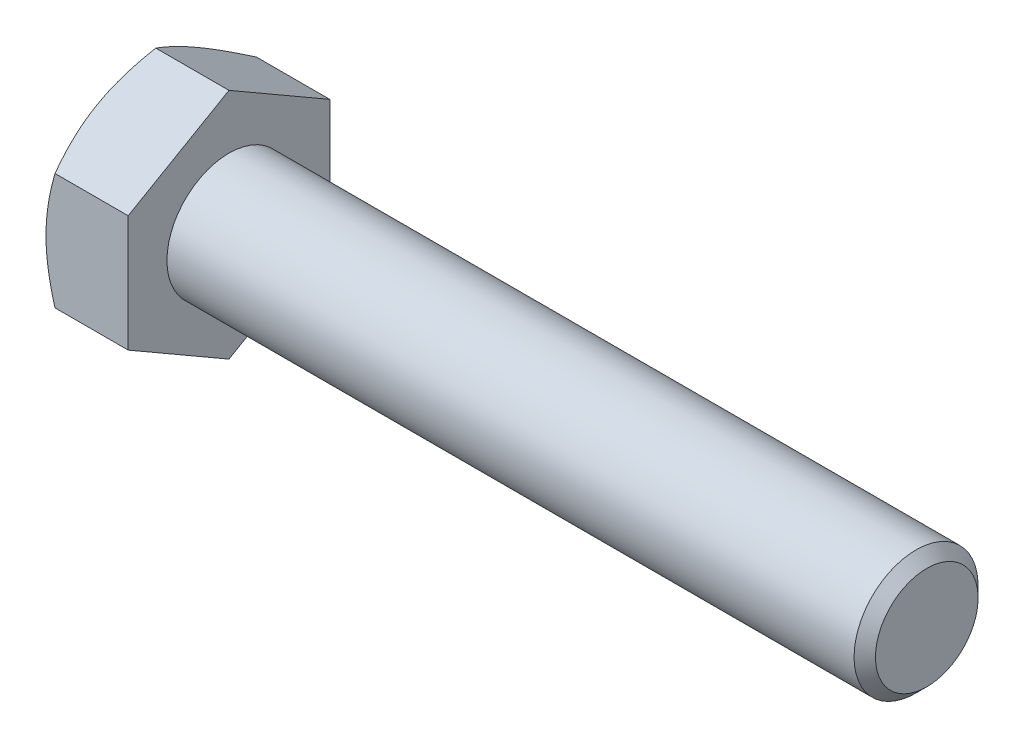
ISO-10303-21;
HEADER;
FILE_DESCRIPTION(('STEP AP214'),'2;1');
FILE_NAME('part.step','',(''),(''),'','','');
FILE_SCHEMA(('AUTOMOTIVE_DESIGN { 1 0 10303 214 1 1 1 1 }'));
ENDSEC;
DATA;
#1=APPLICATION_CONTEXT('core data for automotive mechanical design processes');
#2=APPLICATION_PROTOCOL_DEFINITION('international standard','automotive_design',2000,#1);
#3=PRODUCT_CONTEXT('',#1,'mechanical');
#4=PRODUCT('Part','Part','',(#3));
#5=PRODUCT_RELATED_PRODUCT_CATEGORY('part','',(#4));
#6=PRODUCT_DEFINITION_FORMATION('','',#4);
#7=PRODUCT_DEFINITION_CONTEXT('part definition',#1,'design');
#8=PRODUCT_DEFINITION('design','',#6,#7);
#9=PRODUCT_DEFINITION_SHAPE('','',#8);
#10=(LENGTH_UNIT() NAMED_UNIT(*) SI_UNIT(.MILLI.,.METRE.));
#11=(NAMED_UNIT(*) PLANE_ANGLE_UNIT() SI_UNIT($,.RADIAN.));
#12=(NAMED_UNIT(*) SI_UNIT($,.STERADIAN.) SOLID_ANGLE_UNIT());
#13=UNCERTAINTY_MEASURE_WITH_UNIT(LENGTH_MEASURE(1.E-05),#10,'distance_accuracy_value','');
#14=(GEOMETRIC_REPRESENTATION_CONTEXT(3) GLOBAL_UNCERTAINTY_ASSIGNED_CONTEXT((#13)) GLOBAL_UNIT_ASSIGNED_CONTEXT((#10,
#11,#12)) REPRESENTATION_CONTEXT('',''));
#15=CARTESIAN_POINT('',(0.,0.,0.));
#16=DIRECTION('',(0.,0.,1.));
#17=DIRECTION('',(1.,0.,0.));
#18=AXIS2_PLACEMENT_3D('',#15,#16,#17);
#19=CARTESIAN_POINT('',(5.3,3.75277674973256,-6.5));
#20=DIRECTION('',(0.,-0.866025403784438,0.500000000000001));
#21=DIRECTION('',(0.,-0.500000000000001,-0.866025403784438));
#22=AXIS2_PLACEMENT_3D('',#19,#20,#21);
#23=PLANE('',#22);
#24=CARTESIAN_POINT('',(0.580623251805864,7.50566896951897,0.0002));
#25=CARTESIAN_POINT('',(0.533004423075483,7.4231786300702,-0.14267745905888));
#26=CARTESIAN_POINT('',(0.487546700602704,7.34038072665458,-0.286087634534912));
#27=CARTESIAN_POINT('',(0.401548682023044,7.17411251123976,-0.574072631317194));
#28=CARTESIAN_POINT('',(0.361010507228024,7.09064192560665,-0.718647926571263));
#29=CARTESIAN_POINT('',(0.247571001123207,6.83889369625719,-1.15468865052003));
#30=CARTESIAN_POINT('',(0.183047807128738,6.66962231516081,-1.44787528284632));
#31=CARTESIAN_POINT('',(0.107386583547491,6.41631077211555,-1.88662374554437));
#32=CARTESIAN_POINT('',(0.0858328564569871,6.33302748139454,-2.03087463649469));
#33=CARTESIAN_POINT('',(0.0496903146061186,6.16608458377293,-2.32002821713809));
#34=CARTESIAN_POINT('',(0.0351008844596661,6.08242501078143,-2.46493084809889));
#35=CARTESIAN_POINT('',(0.0132587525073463,5.91496056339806,-2.75498777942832));
#36=CARTESIAN_POINT('',(0.00599772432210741,5.8311559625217,-2.90014160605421));
#37=CARTESIAN_POINT('',(-0.00103969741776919,5.66347396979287,-3.19057533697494));
#38=CARTESIAN_POINT('',(-0.000816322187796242,5.5795965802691,-3.33585523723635));
#39=CARTESIAN_POINT('',(0.0100834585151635,5.34979921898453,-3.73387594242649));
#40=CARTESIAN_POINT('',(0.0283818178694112,5.20395446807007,-3.98648646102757));
#41=CARTESIAN_POINT('',(0.0864063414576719,4.91323365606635,-4.49002967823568));
#42=CARTESIAN_POINT('',(0.126152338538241,4.76835861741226,-4.74096060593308));
#43=CARTESIAN_POINT('',(0.225505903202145,4.47705272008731,-5.24551722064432));
#44=CARTESIAN_POINT('',(0.285534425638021,4.33065861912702,-5.49907924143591));
#45=CARTESIAN_POINT('',(0.421774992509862,4.04005357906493,-6.00242193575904));
#46=CARTESIAN_POINT('',(0.497955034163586,3.89583891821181,-6.25220905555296));
#47=CARTESIAN_POINT('',(0.58062325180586,3.75266127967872,-6.5002));
#48=B_SPLINE_CURVE_WITH_KNOTS('',3,(#24,#25,#26,#27,#28,#29,#30,#31,#32,#33,#34,#35,#36,#37,#38,
#39,#40,#41,#42,#43,#44,#45,#46,#47),.UNSPECIFIED.,.F.,.F.,(4,2,2,2,2,2,2,2,2,2,2,4),(0.,
0.515105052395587,1.03043143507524,2.06322554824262,2.56697389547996,3.07067772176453,
3.57380860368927,4.0769239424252,4.9527935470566,5.82947446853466,6.72559912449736,
7.61996451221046),.UNSPECIFIED.);
#49=CARTESIAN_POINT('',(0.58055658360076,7.50555349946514,0.));
#50=VERTEX_POINT('',#49);
#51=CARTESIAN_POINT('',(0.,5.62916512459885,-3.25000000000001));
#52=VERTEX_POINT('',#51);
#53=EDGE_CURVE('E54',#50,#52,#48,.T.);
#54=ORIENTED_EDGE('',*,*,#53,.F.);
#55=DIRECTION('',(-1.,0.,0.));
#56=VECTOR('',#55,1.);
#57=CARTESIAN_POINT('',(5.3,7.50555349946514,0.));
#58=LINE('',#57,#56);
#59=CARTESIAN_POINT('',(5.3,7.50555349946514,0.));
#60=VERTEX_POINT('',#59);
#61=EDGE_CURVE('E150',#60,#50,#58,.T.);
#62=ORIENTED_EDGE('',*,*,#61,.F.);
#63=DIRECTION('',(0.,0.500000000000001,0.866025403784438));
#64=VECTOR('',#63,1.);
#65=CARTESIAN_POINT('',(5.3,3.75277674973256,-6.5));
#66=LINE('',#65,#64);
#67=CARTESIAN_POINT('',(5.3,3.75277674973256,-6.5));
#68=VERTEX_POINT('',#67);
#69=EDGE_CURVE('E235',#68,#60,#66,.T.);
#70=ORIENTED_EDGE('',*,*,#69,.F.);
#71=DIRECTION('',(-1.,0.,0.));
#72=VECTOR('',#71,1.);
#73=CARTESIAN_POINT('',(5.3,3.75277674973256,-6.5));
#74=LINE('',#73,#72);
#75=CARTESIAN_POINT('',(0.580556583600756,3.75277674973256,-6.5));
#76=VERTEX_POINT('',#75);
#77=EDGE_CURVE('E138',#68,#76,#74,.T.);
#78=ORIENTED_EDGE('',*,*,#77,.T.);
#79=EDGE_CURVE('E132',#52,#76,#48,.T.);
#80=ORIENTED_EDGE('',*,*,#79,.F.);
#81=EDGE_LOOP('',(#54,#62,#70,#78,#80));
#82=FACE_BOUND('',#81,.T.);
#83=ADVANCED_FACE('F38',(#82),#23,.F.);
#84=CARTESIAN_POINT('',(5.3,7.50555349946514,0.));
#85=DIRECTION('',(0.,-0.866025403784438,-0.500000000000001));
#86=DIRECTION('',(0.,0.500000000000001,-0.866025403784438));
#87=AXIS2_PLACEMENT_3D('',#84,#85,#86);
#88=PLANE('',#87);
#89=CARTESIAN_POINT('',(0.580623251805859,3.75266127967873,6.50019999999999));
#90=CARTESIAN_POINT('',(0.533004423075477,3.8351516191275,6.35732254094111));
#91=CARTESIAN_POINT('',(0.487546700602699,3.91794952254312,6.21391236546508));
#92=CARTESIAN_POINT('',(0.401548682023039,4.08421773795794,5.9259273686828));
#93=CARTESIAN_POINT('',(0.361010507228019,4.16768832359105,5.78135207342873));
#94=CARTESIAN_POINT('',(0.247571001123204,4.41943655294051,5.34531134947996));
#95=CARTESIAN_POINT('',(0.183047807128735,4.58870793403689,5.05212471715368));
#96=CARTESIAN_POINT('',(0.107386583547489,4.84201947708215,4.61337625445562));
#97=CARTESIAN_POINT('',(0.0858328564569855,4.92530276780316,4.46912536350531));
#98=CARTESIAN_POINT('',(0.0496903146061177,5.09224566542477,4.17997178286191));
#99=CARTESIAN_POINT('',(0.0351008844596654,5.17590523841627,4.03506915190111));
#100=CARTESIAN_POINT('',(0.0132587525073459,5.34336968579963,3.74501222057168));
#101=CARTESIAN_POINT('',(0.00599772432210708,5.427174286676,3.59985839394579));
#102=CARTESIAN_POINT('',(-0.00103969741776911,5.59485627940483,3.30942466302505));
#103=CARTESIAN_POINT('',(-0.000816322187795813,5.6787336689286,3.16414476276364));
#104=CARTESIAN_POINT('',(0.0100834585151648,5.90853103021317,2.76612405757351));
#105=CARTESIAN_POINT('',(0.0283818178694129,6.05437578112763,2.51351353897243));
#106=CARTESIAN_POINT('',(0.0864063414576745,6.34509659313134,2.00997032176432));
#107=CARTESIAN_POINT('',(0.126152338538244,6.48997163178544,1.75903939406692));
#108=CARTESIAN_POINT('',(0.225505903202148,6.78127752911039,1.25448277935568));
#109=CARTESIAN_POINT('',(0.285534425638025,6.92767163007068,1.00092075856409));
#110=CARTESIAN_POINT('',(0.421774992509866,7.21827667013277,0.497578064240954));
#111=CARTESIAN_POINT('',(0.49795503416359,7.36249133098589,0.247790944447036));
#112=CARTESIAN_POINT('',(0.580623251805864,7.50566896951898,-0.000200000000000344));
#113=B_SPLINE_CURVE_WITH_KNOTS('',3,(#89,#90,#91,#92,#93,#94,#95,#96,#97,#98,#99,#100,#101,#102,
#103,#104,#105,#106,#107,#108,#109,#110,#111,#112),.UNSPECIFIED.,.F.,.F.,(4,2,2,2,2,2,2,2,2,2,2,
4),(0.,0.515105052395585,1.03043143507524,2.06322554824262,2.56697389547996,3.07067772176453,
3.57380860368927,4.07692394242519,4.95279354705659,5.82947446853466,6.72559912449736,
7.61996451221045),.UNSPECIFIED.);
#114=CARTESIAN_POINT('',(0.580556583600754,3.75277674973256,6.49999999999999));
#115=VERTEX_POINT('',#114);
#116=CARTESIAN_POINT('',(0.,5.62916512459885,3.25000000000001));
#117=VERTEX_POINT('',#116);
#118=EDGE_CURVE('E61',#115,#117,#113,.T.);
#119=ORIENTED_EDGE('',*,*,#118,.F.);
#120=DIRECTION('',(-1.,0.,0.));
#121=VECTOR('',#120,1.);
#122=CARTESIAN_POINT('',(5.3,3.75277674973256,6.49999999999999));
#123=LINE('',#122,#121);
#124=CARTESIAN_POINT('',(5.3,3.75277674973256,6.49999999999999));
#125=VERTEX_POINT('',#124);
#126=EDGE_CURVE('E148',#125,#115,#123,.T.);
#127=ORIENTED_EDGE('',*,*,#126,.F.);
#128=DIRECTION('',(0.,-0.500000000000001,0.866025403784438));
#129=VECTOR('',#128,1.);
#130=CARTESIAN_POINT('',(5.3,7.50555349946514,0.));
#131=LINE('',#130,#129);
#132=EDGE_CURVE('E233',#60,#125,#131,.T.);
#133=ORIENTED_EDGE('',*,*,#132,.F.);
#134=ORIENTED_EDGE('',*,*,#61,.T.);
#135=EDGE_CURVE('E165',#117,#50,#113,.T.);
#136=ORIENTED_EDGE('',*,*,#135,.F.);
#137=EDGE_LOOP('',(#119,#127,#133,#134,#136));
#138=FACE_BOUND('',#137,.T.);
#139=ADVANCED_FACE('F171',(#138),#88,.F.);
#140=CARTESIAN_POINT('',(5.3,3.75277674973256,6.49999999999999));
#141=DIRECTION('',(0.,0.,-1.));
#142=DIRECTION('',(0.,1.,0.));
#143=AXIS2_PLACEMENT_3D('',#140,#141,#142);
#144=PLANE('',#143);
#145=CARTESIAN_POINT('',(3.18835311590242,-10.1137456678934,6.5));
#146=CARTESIAN_POINT('',(3.05034774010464,-9.82952666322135,6.5));
#147=CARTESIAN_POINT('',(2.91365616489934,-9.54465869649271,6.5));
#148=CARTESIAN_POINT('',(2.64363899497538,-8.97327978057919,6.5));
#149=CARTESIAN_POINT('',(2.51031392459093,-8.68676858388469,6.5));
#150=CARTESIAN_POINT('',(2.24710473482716,-8.11029837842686,6.5));
#151=CARTESIAN_POINT('',(2.11724300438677,-7.82032911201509,6.5));
#152=CARTESIAN_POINT('',(1.862790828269,-7.23809541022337,6.5));
#153=CARTESIAN_POINT('',(1.73820013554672,-6.94583108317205,6.5));
#154=CARTESIAN_POINT('',(1.49176685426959,-6.34906440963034,6.5));
#155=CARTESIAN_POINT('',(1.37014257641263,-6.0444714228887,6.5));
#156=CARTESIAN_POINT('',(1.13601865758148,-5.43173420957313,6.5));
#157=CARTESIAN_POINT('',(1.02352003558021,-5.12358959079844,6.5));
#158=CARTESIAN_POINT('',(0.810575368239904,-4.50382569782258,6.5));
#159=CARTESIAN_POINT('',(0.710105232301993,-4.19221478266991,6.5));
#160=CARTESIAN_POINT('',(0.524420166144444,-3.5645201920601,6.5));
#161=CARTESIAN_POINT('',(0.439200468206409,-3.24843794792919,6.5));
#162=CARTESIAN_POINT('',(0.288524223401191,-2.61335465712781,6.5));
#163=CARTESIAN_POINT('',(0.222961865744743,-2.29437912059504,6.5));
#164=CARTESIAN_POINT('',(0.115312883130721,-1.65238219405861,6.5));
#165=CARTESIAN_POINT('',(0.0732239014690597,-1.32936121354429,6.5));
#166=CARTESIAN_POINT('',(0.0304887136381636,-0.845231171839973,6.5));
#167=CARTESIAN_POINT('',(0.0196493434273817,-0.68498220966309,6.5));
#168=CARTESIAN_POINT('',(0.00475298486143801,-0.364162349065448,6.5));
#169=CARTESIAN_POINT('',(0.000695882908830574,-0.203591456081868,6.5));
#170=CARTESIAN_POINT('',(-0.000531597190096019,0.117577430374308,6.5));
#171=CARTESIAN_POINT('',(0.00229809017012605,0.278175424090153,6.5));
#172=CARTESIAN_POINT('',(0.014772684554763,0.599108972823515,6.5));
#173=CARTESIAN_POINT('',(0.0244179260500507,0.759444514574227,6.5));
#174=CARTESIAN_POINT('',(0.0554961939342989,1.14369946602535,6.5));
#175=CARTESIAN_POINT('',(0.0801030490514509,1.36736763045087,6.49999999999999));
#176=CARTESIAN_POINT('',(0.141246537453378,1.8130559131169,6.49999999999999));
#177=CARTESIAN_POINT('',(0.177784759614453,2.03507580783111,6.49999999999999));
#178=CARTESIAN_POINT('',(0.303360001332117,2.69839633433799,6.49999999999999));
#179=CARTESIAN_POINT('',(0.408335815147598,3.1367201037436,6.49999999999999));
#180=CARTESIAN_POINT('',(0.590564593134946,3.79232112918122,6.49999999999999));
#181=CARTESIAN_POINT('',(0.656313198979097,4.01299150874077,6.49999999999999));
#182=CARTESIAN_POINT('',(0.794681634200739,4.45218859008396,6.49999999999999));
#183=CARTESIAN_POINT('',(0.867301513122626,4.67071527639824,6.49999999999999));
#184=CARTESIAN_POINT('',(1.01824353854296,5.10569490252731,6.49999999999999));
#185=CARTESIAN_POINT('',(1.0965638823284,5.32214847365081,6.49999999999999));
#186=CARTESIAN_POINT('',(1.25798086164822,5.75325725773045,6.49999999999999));
#187=CARTESIAN_POINT('',(1.34107741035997,5.96791250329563,6.49999999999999));
#188=CARTESIAN_POINT('',(1.56029019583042,6.51888445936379,6.49999999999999));
#189=CARTESIAN_POINT('',(1.69936356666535,6.85402316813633,6.49999999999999));
#190=CARTESIAN_POINT('',(1.98501958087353,7.52109583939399,6.49999999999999));
#191=CARTESIAN_POINT('',(2.13160288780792,7.85302951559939,6.49999999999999));
#192=CARTESIAN_POINT('',(2.43059748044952,8.51437865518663,6.49999999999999));
#193=CARTESIAN_POINT('',(2.58301057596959,8.84379329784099,6.49999999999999));
#194=CARTESIAN_POINT('',(2.89234869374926,9.50047798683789,6.49999999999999));
#195=CARTESIAN_POINT('',(3.04927357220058,9.82774810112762,6.49999999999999));
#196=CARTESIAN_POINT('',(3.36692013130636,10.4809971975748,6.49999999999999));
#197=CARTESIAN_POINT('',(3.52764676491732,10.8069737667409,6.49999999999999));
#198=CARTESIAN_POINT('',(3.85198555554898,11.4574882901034,6.49999999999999));
#199=CARTESIAN_POINT('',(4.01559773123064,11.7820262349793,6.49999999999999));
#200=CARTESIAN_POINT('',(4.50986185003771,12.7537468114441,6.49999999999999));
#201=CARTESIAN_POINT('',(4.84399997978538,13.3991555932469,6.49999999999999));
#202=CARTESIAN_POINT('',(5.48575990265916,14.6239779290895,6.49999999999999));
#203=CARTESIAN_POINT('',(5.79279643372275,15.2036995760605,6.49999999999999));
#204=CARTESIAN_POINT('',(6.41069188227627,16.3611382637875,6.49999999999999));
#205=CARTESIAN_POINT('',(6.72155099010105,16.9388552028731,6.49999999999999));
#206=CARTESIAN_POINT('',(7.3451977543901,18.0910273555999,6.49999999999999));
#207=CARTESIAN_POINT('',(7.6579769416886,18.6654871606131,6.49999999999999));
#208=CARTESIAN_POINT('',(8.28574397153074,19.8131486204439,6.49999999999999));
#209=CARTESIAN_POINT('',(8.60073166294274,20.3863503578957,6.49999999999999));
#210=CARTESIAN_POINT('',(8.91652967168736,20.9591024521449,6.49999999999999));
#211=B_SPLINE_CURVE_WITH_KNOTS('',3,(#145,#146,#147,#148,#149,#150,#151,#152,#153,#154,#155,
#156,#157,#158,#159,#160,#161,#162,#163,#164,#165,#166,#167,#168,#169,#170,#171,#172,#173,#174,
#175,#176,#177,#178,#179,#180,#181,#182,#183,#184,#185,#186,#187,#188,#189,#190,#191,#192,#193,
#194,#195,#196,#197,#198,#199,#200,#201,#202,#203,#204,#205,#206,#207,#208,#209,#210),
.UNSPECIFIED.,.F.,.F.,(4,2,2,2,2,2,2,2,2,2,2,2,2,2,2,2,2,2,2,2,2,2,2,2,2,2,2,2,2,2,2,2,4),(0.,
0.947868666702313,1.89588406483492,2.84900320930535,3.80207763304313,4.78589774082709,
5.76982755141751,6.75175256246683,7.73337005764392,8.70960474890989,9.68574140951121,
10.1674651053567,10.6491807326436,11.1309009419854,11.6126447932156,12.287317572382,
12.9620802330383,14.312318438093,15.0030310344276,15.6937486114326,16.3842486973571,
17.0747362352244,18.1631508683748,19.2516618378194,20.3405135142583,21.4293305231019,
22.5196540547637,23.6099846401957,25.7902468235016,27.7582608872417,29.7263733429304,
31.6886408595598,33.6507753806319),.UNSPECIFIED.);
#212=CARTESIAN_POINT('',(0.580556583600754,-3.75277674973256,6.5));
#213=VERTEX_POINT('',#212);
#214=CARTESIAN_POINT('',(0.,0.,6.5));
#215=VERTEX_POINT('',#214);
#216=EDGE_CURVE('E245',#213,#215,#211,.T.);
#217=ORIENTED_EDGE('',*,*,#216,.F.);
#218=DIRECTION('',(-1.,0.,0.));
#219=VECTOR('',#218,1.);
#220=CARTESIAN_POINT('',(5.3,-3.75277674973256,6.5));
#221=LINE('',#220,#219);
#222=CARTESIAN_POINT('',(5.3,-3.75277674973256,6.5));
#223=VERTEX_POINT('',#222);
#224=EDGE_CURVE('E140',#223,#213,#221,.T.);
#225=ORIENTED_EDGE('',*,*,#224,.F.);
#226=DIRECTION('',(0.,-1.,0.));
#227=VECTOR('',#226,1.);
#228=CARTESIAN_POINT('',(5.3,3.75277674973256,6.49999999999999));
#229=LINE('',#228,#227);
#230=EDGE_CURVE('E229',#125,#223,#229,.T.);
#231=ORIENTED_EDGE('',*,*,#230,.F.);
#232=ORIENTED_EDGE('',*,*,#126,.T.);
#233=EDGE_CURVE('E187',#215,#115,#211,.T.);
#234=ORIENTED_EDGE('',*,*,#233,.F.);
#235=EDGE_LOOP('',(#217,#225,#231,#232,#234));
#236=FACE_BOUND('',#235,.T.);
#237=ADVANCED_FACE('F251',(#236),#144,.F.);
#238=CARTESIAN_POINT('',(5.3,-7.50555349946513,0.));
#239=DIRECTION('',(0.,0.866025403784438,-0.500000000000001));
#240=DIRECTION('',(0.,0.500000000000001,0.866025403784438));
#241=AXIS2_PLACEMENT_3D('',#238,#239,#240);
#242=PLANE('',#241);
#243=CARTESIAN_POINT('',(0.580623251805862,-7.50566896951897,-0.000199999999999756));
#244=CARTESIAN_POINT('',(0.533004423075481,-7.4231786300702,0.14267745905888));
#245=CARTESIAN_POINT('',(0.487546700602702,-7.34038072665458,0.286087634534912));
#246=CARTESIAN_POINT('',(0.401548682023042,-7.17411251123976,0.574072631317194));
#247=CARTESIAN_POINT('',(0.361010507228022,-7.09064192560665,0.718647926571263));
#248=CARTESIAN_POINT('',(0.247571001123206,-6.83889369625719,1.15468865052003));
#249=CARTESIAN_POINT('',(0.183047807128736,-6.6696223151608,1.44787528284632));
#250=CARTESIAN_POINT('',(0.107386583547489,-6.41631077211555,1.88662374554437));
#251=CARTESIAN_POINT('',(0.0858328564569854,-6.33302748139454,2.03087463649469));
#252=CARTESIAN_POINT('',(0.049690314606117,-6.16608458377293,2.32002821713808));
#253=CARTESIAN_POINT('',(0.0351008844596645,-6.08242501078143,2.46493084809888));
#254=CARTESIAN_POINT('',(0.0132587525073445,-5.91496056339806,2.75498777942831));
#255=CARTESIAN_POINT('',(0.00599772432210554,-5.8311559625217,2.9001416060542));
#256=CARTESIAN_POINT('',(-0.00103969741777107,-5.66347396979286,3.19057533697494));
#257=CARTESIAN_POINT('',(-0.000816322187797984,-5.5795965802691,3.33585523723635));
#258=CARTESIAN_POINT('',(0.0100834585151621,-5.34979921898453,3.73387594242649));
#259=CARTESIAN_POINT('',(0.0283818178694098,-5.20395446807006,3.98648646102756));
#260=CARTESIAN_POINT('',(0.0864063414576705,-4.91323365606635,4.49002967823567));
#261=CARTESIAN_POINT('',(0.126152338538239,-4.76835861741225,4.74096060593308));
#262=CARTESIAN_POINT('',(0.225505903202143,-4.47705272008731,5.24551722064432));
#263=CARTESIAN_POINT('',(0.28553442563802,-4.33065861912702,5.49907924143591));
#264=CARTESIAN_POINT('',(0.42177499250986,-4.04005357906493,6.00242193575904));
#265=CARTESIAN_POINT('',(0.497955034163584,-3.89583891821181,6.25220905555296));
#266=CARTESIAN_POINT('',(0.580623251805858,-3.75266127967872,6.5002));
#267=B_SPLINE_CURVE_WITH_KNOTS('',3,(#243,#244,#245,#246,#247,#248,#249,#250,#251,#252,#253,
#254,#255,#256,#257,#258,#259,#260,#261,#262,#263,#264,#265,#266),.UNSPECIFIED.,.F.,.F.,(4,2,2,
2,2,2,2,2,2,2,2,4),(0.,0.515105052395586,1.03043143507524,2.06322554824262,2.56697389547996,
3.07067772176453,3.57380860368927,4.07692394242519,4.9527935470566,5.82947446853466,
6.72559912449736,7.61996451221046),.UNSPECIFIED.);
#268=CARTESIAN_POINT('',(0.580556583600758,-7.50555349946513,0.));
#269=VERTEX_POINT('',#268);
#270=CARTESIAN_POINT('',(0.,-5.62916512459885,3.25000000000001));
#271=VERTEX_POINT('',#270);
#272=EDGE_CURVE('E173',#269,#271,#267,.T.);
#273=ORIENTED_EDGE('',*,*,#272,.F.);
#274=DIRECTION('',(-1.,0.,0.));
#275=VECTOR('',#274,1.);
#276=CARTESIAN_POINT('',(5.3,-7.50555349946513,0.));
#277=LINE('',#276,#275);
#278=CARTESIAN_POINT('',(5.3,-7.50555349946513,0.));
#279=VERTEX_POINT('',#278);
#280=EDGE_CURVE('E137',#279,#269,#277,.T.);
#281=ORIENTED_EDGE('',*,*,#280,.F.);
#282=DIRECTION('',(0.,-0.500000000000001,-0.866025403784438));
#283=VECTOR('',#282,1.);
#284=CARTESIAN_POINT('',(5.3,-7.50555349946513,0.));
#285=LINE('',#284,#283);
#286=EDGE_CURVE('E227',#223,#279,#285,.T.);
#287=ORIENTED_EDGE('',*,*,#286,.F.);
#288=ORIENTED_EDGE('',*,*,#224,.T.);
#289=EDGE_CURVE('E175',#271,#213,#267,.T.);
#290=ORIENTED_EDGE('',*,*,#289,.F.);
#291=EDGE_LOOP('',(#273,#281,#287,#288,#290));
#292=FACE_BOUND('',#291,.T.);
#293=ADVANCED_FACE('F223',(#292),#242,.F.);
#294=CARTESIAN_POINT('',(5.3,-3.75277674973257,-6.5));
#295=DIRECTION('',(0.,0.866025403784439,0.499999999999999));
#296=DIRECTION('',(0.,-0.5,0.866025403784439));
#297=AXIS2_PLACEMENT_3D('',#294,#295,#296);
#298=PLANE('',#297);
#299=CARTESIAN_POINT('',(0.580623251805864,-3.75266127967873,-6.5002));
#300=CARTESIAN_POINT('',(0.533004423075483,-3.83515161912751,-6.35732254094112));
#301=CARTESIAN_POINT('',(0.487546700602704,-3.91794952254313,-6.21391236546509));
#302=CARTESIAN_POINT('',(0.401548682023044,-4.08421773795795,-5.92592736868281));
#303=CARTESIAN_POINT('',(0.361010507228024,-4.16768832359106,-5.78135207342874));
#304=CARTESIAN_POINT('',(0.247571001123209,-4.41943655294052,-5.34531134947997));
#305=CARTESIAN_POINT('',(0.18304780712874,-4.5887079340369,-5.05212471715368));
#306=CARTESIAN_POINT('',(0.107386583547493,-4.84201947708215,-4.61337625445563));
#307=CARTESIAN_POINT('',(0.0858328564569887,-4.92530276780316,-4.46912536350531));
#308=CARTESIAN_POINT('',(0.0496903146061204,-5.09224566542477,-4.17997178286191));
#309=CARTESIAN_POINT('',(0.0351008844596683,-5.17590523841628,-4.03506915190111));
#310=CARTESIAN_POINT('',(0.0132587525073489,-5.34336968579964,-3.74501222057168));
#311=CARTESIAN_POINT('',(0.00599772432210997,-5.427174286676,-3.59985839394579));
#312=CARTESIAN_POINT('',(-0.0010396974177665,-5.59485627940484,-3.30942466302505));
#313=CARTESIAN_POINT('',(-0.000816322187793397,-5.6787336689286,-3.16414476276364));
#314=CARTESIAN_POINT('',(0.0100834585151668,-5.90853103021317,-2.76612405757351));
#315=CARTESIAN_POINT('',(0.0283818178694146,-6.05437578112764,-2.51351353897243));
#316=CARTESIAN_POINT('',(0.0864063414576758,-6.34509659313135,-2.00997032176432));
#317=CARTESIAN_POINT('',(0.126152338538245,-6.48997163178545,-1.75903939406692));
#318=CARTESIAN_POINT('',(0.225505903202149,-6.78127752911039,-1.25448277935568));
#319=CARTESIAN_POINT('',(0.285534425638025,-6.92767163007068,-1.00092075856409));
#320=CARTESIAN_POINT('',(0.421774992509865,-7.21827667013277,-0.497578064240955));
#321=CARTESIAN_POINT('',(0.497955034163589,-7.36249133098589,-0.247790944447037));
#322=CARTESIAN_POINT('',(0.580623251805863,-7.50566896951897,0.000199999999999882));
#323=B_SPLINE_CURVE_WITH_KNOTS('',3,(#299,#300,#301,#302,#303,#304,#305,#306,#307,#308,#309,
#310,#311,#312,#313,#314,#315,#316,#317,#318,#319,#320,#321,#322),.UNSPECIFIED.,.F.,.F.,(4,2,2,
2,2,2,2,2,2,2,2,4),(0.,0.515105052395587,1.03043143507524,2.06322554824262,2.56697389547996,
3.07067772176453,3.57380860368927,4.0769239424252,4.9527935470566,5.82947446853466,
6.72559912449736,7.61996451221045),.UNSPECIFIED.);
#324=CARTESIAN_POINT('',(0.58055658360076,-3.75277674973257,-6.5));
#325=VERTEX_POINT('',#324);
#326=CARTESIAN_POINT('',(0.,-5.62916512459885,-3.25));
#327=VERTEX_POINT('',#326);
#328=EDGE_CURVE('E114',#325,#327,#323,.T.);
#329=ORIENTED_EDGE('',*,*,#328,.F.);
#330=DIRECTION('',(-1.,0.,0.));
#331=VECTOR('',#330,1.);
#332=CARTESIAN_POINT('',(5.3,-3.75277674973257,-6.5));
#333=LINE('',#332,#331);
#334=CARTESIAN_POINT('',(5.3,-3.75277674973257,-6.5));
#335=VERTEX_POINT('',#334);
#336=EDGE_CURVE('E128',#335,#325,#333,.T.);
#337=ORIENTED_EDGE('',*,*,#336,.F.);
#338=DIRECTION('',(0.,0.499999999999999,-0.866025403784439));
#339=VECTOR('',#338,1.);
#340=CARTESIAN_POINT('',(5.3,-3.75277674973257,-6.5));
#341=LINE('',#340,#339);
#342=EDGE_CURVE('E225',#279,#335,#341,.T.);
#343=ORIENTED_EDGE('',*,*,#342,.F.);
#344=ORIENTED_EDGE('',*,*,#280,.T.);
#345=EDGE_CURVE('E131',#327,#269,#323,.T.);
#346=ORIENTED_EDGE('',*,*,#345,.F.);
#347=EDGE_LOOP('',(#329,#337,#343,#344,#346));
#348=FACE_BOUND('',#347,.T.);
#349=ADVANCED_FACE('F126',(#348),#298,.F.);
#350=CARTESIAN_POINT('',(5.3,3.75277674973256,-6.5));
#351=DIRECTION('',(0.,0.,1.));
#352=DIRECTION('',(0.,-1.,0.));
#353=AXIS2_PLACEMENT_3D('',#350,#351,#352);
#354=PLANE('',#353);
#355=CARTESIAN_POINT('',(3.18835311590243,-10.1137456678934,-6.5));
#356=CARTESIAN_POINT('',(3.05034774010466,-9.82952666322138,-6.5));
#357=CARTESIAN_POINT('',(2.91365616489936,-9.54465869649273,-6.5));
#358=CARTESIAN_POINT('',(2.64363899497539,-8.97327978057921,-6.5));
#359=CARTESIAN_POINT('',(2.51031392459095,-8.68676858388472,-6.5));
#360=CARTESIAN_POINT('',(2.24710473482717,-8.11029837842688,-6.5));
#361=CARTESIAN_POINT('',(2.11724300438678,-7.82032911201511,-6.5));
#362=CARTESIAN_POINT('',(1.86279082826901,-7.23809541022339,-6.5));
#363=CARTESIAN_POINT('',(1.73820013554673,-6.94583108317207,-6.5));
#364=CARTESIAN_POINT('',(1.4917668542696,-6.34906440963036,-6.5));
#365=CARTESIAN_POINT('',(1.37014257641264,-6.04447142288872,-6.5));
#366=CARTESIAN_POINT('',(1.13601865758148,-5.43173420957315,-6.5));
#367=CARTESIAN_POINT('',(1.02352003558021,-5.12358959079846,-6.5));
#368=CARTESIAN_POINT('',(0.810575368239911,-4.50382569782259,-6.5));
#369=CARTESIAN_POINT('',(0.710105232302,-4.19221478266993,-6.5));
#370=CARTESIAN_POINT('',(0.52442016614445,-3.56452019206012,-6.5));
#371=CARTESIAN_POINT('',(0.439200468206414,-3.24843794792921,-6.5));
#372=CARTESIAN_POINT('',(0.288524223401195,-2.61335465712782,-6.5));
#373=CARTESIAN_POINT('',(0.222961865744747,-2.29437912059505,-6.5));
#374=CARTESIAN_POINT('',(0.115312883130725,-1.65238219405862,-6.5));
#375=CARTESIAN_POINT('',(0.0732239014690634,-1.3293612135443,-6.5));
#376=CARTESIAN_POINT('',(0.0304887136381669,-0.845231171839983,-6.5));
#377=CARTESIAN_POINT('',(0.0196493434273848,-0.6849822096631,-6.5));
#378=CARTESIAN_POINT('',(0.00475298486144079,-0.364162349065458,-6.5));
#379=CARTESIAN_POINT('',(0.000695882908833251,-0.203591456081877,-6.5));
#380=CARTESIAN_POINT('',(-0.0005315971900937,0.117577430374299,-6.5));
#381=CARTESIAN_POINT('',(0.00229809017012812,0.278175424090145,-6.5));
#382=CARTESIAN_POINT('',(0.014772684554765,0.599108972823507,-6.5));
#383=CARTESIAN_POINT('',(0.0244179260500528,0.759444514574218,-6.5));
#384=CARTESIAN_POINT('',(0.055496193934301,1.14369946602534,-6.5));
#385=CARTESIAN_POINT('',(0.0801030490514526,1.36736763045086,-6.5));
#386=CARTESIAN_POINT('',(0.141246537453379,1.81305591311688,-6.5));
#387=CARTESIAN_POINT('',(0.177784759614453,2.03507580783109,-6.5));
#388=CARTESIAN_POINT('',(0.303360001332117,2.69839633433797,-6.5));
#389=CARTESIAN_POINT('',(0.408335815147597,3.13672010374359,-6.5));
#390=CARTESIAN_POINT('',(0.590564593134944,3.79232112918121,-6.5));
#391=CARTESIAN_POINT('',(0.656313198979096,4.01299150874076,-6.5));
#392=CARTESIAN_POINT('',(0.794681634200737,4.45218859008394,-6.5));
#393=CARTESIAN_POINT('',(0.867301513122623,4.67071527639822,-6.5));
#394=CARTESIAN_POINT('',(1.01824353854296,5.1056949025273,-6.5));
#395=CARTESIAN_POINT('',(1.0965638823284,5.3221484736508,-6.5));
#396=CARTESIAN_POINT('',(1.25798086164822,5.75325725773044,-6.5));
#397=CARTESIAN_POINT('',(1.34107741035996,5.96791250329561,-6.5));
#398=CARTESIAN_POINT('',(1.56029019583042,6.51888445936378,-6.5));
#399=CARTESIAN_POINT('',(1.69936356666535,6.85402316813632,-6.5));
#400=CARTESIAN_POINT('',(1.98501958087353,7.52109583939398,-6.5));
#401=CARTESIAN_POINT('',(2.13160288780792,7.85302951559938,-6.5));
#402=CARTESIAN_POINT('',(2.43059748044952,8.51437865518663,-6.5));
#403=CARTESIAN_POINT('',(2.5830105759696,8.84379329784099,-6.5));
#404=CARTESIAN_POINT('',(2.89234869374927,9.50047798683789,-6.5));
#405=CARTESIAN_POINT('',(3.04927357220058,9.82774810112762,-6.5));
#406=CARTESIAN_POINT('',(3.36692013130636,10.4809971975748,-6.5));
#407=CARTESIAN_POINT('',(3.52764676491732,10.8069737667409,-6.5));
#408=CARTESIAN_POINT('',(3.85198555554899,11.4574882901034,-6.5));
#409=CARTESIAN_POINT('',(4.01559773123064,11.7820262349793,-6.5));
#410=CARTESIAN_POINT('',(4.50986185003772,12.7537468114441,-6.5));
#411=CARTESIAN_POINT('',(4.84399997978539,13.3991555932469,-6.5));
#412=CARTESIAN_POINT('',(5.48575990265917,14.6239779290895,-6.5));
#413=CARTESIAN_POINT('',(5.79279643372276,15.2036995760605,-6.5));
#414=CARTESIAN_POINT('',(6.41069188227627,16.3611382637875,-6.5));
#415=CARTESIAN_POINT('',(6.72155099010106,16.9388552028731,-6.5));
#416=CARTESIAN_POINT('',(7.34519775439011,18.0910273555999,-6.5));
#417=CARTESIAN_POINT('',(7.6579769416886,18.6654871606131,-6.5));
#418=CARTESIAN_POINT('',(8.28574397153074,19.8131486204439,-6.5));
#419=CARTESIAN_POINT('',(8.60073166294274,20.3863503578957,-6.5));
#420=CARTESIAN_POINT('',(8.91652967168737,20.9591024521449,-6.49999999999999));
#421=B_SPLINE_CURVE_WITH_KNOTS('',3,(#355,#356,#357,#358,#359,#360,#361,#362,#363,#364,#365,
#366,#367,#368,#369,#370,#371,#372,#373,#374,#375,#376,#377,#378,#379,#380,#381,#382,#383,#384,
#385,#386,#387,#388,#389,#390,#391,#392,#393,#394,#395,#396,#397,#398,#399,#400,#401,#402,#403,
#404,#405,#406,#407,#408,#409,#410,#411,#412,#413,#414,#415,#416,#417,#418,#419,#420),
.UNSPECIFIED.,.F.,.F.,(4,2,2,2,2,2,2,2,2,2,2,2,2,2,2,2,2,2,2,2,2,2,2,2,2,2,2,2,2,2,2,2,4),(0.,
0.947868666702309,1.89588406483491,2.84900320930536,3.80207763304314,4.7858977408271,
5.76982755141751,6.75175256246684,7.73337005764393,8.7096047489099,9.68574140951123,
10.1674651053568,10.6491807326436,11.1309009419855,11.6126447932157,12.287317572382,
12.9620802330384,14.312318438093,15.0030310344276,15.6937486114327,16.3842486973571,
17.0747362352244,18.1631508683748,19.2516618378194,20.3405135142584,21.429330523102,
22.5196540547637,23.6099846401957,25.7902468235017,27.7582608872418,29.7263733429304,
31.6886408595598,33.6507753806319),.UNSPECIFIED.);
#422=CARTESIAN_POINT('',(0.,0.,-6.5));
#423=VERTEX_POINT('',#422);
#424=EDGE_CURVE('E120',#76,#423,#421,.F.);
#425=ORIENTED_EDGE('',*,*,#424,.F.);
#426=ORIENTED_EDGE('',*,*,#77,.F.);
#427=DIRECTION('',(0.,1.,0.));
#428=VECTOR('',#427,1.);
#429=CARTESIAN_POINT('',(5.3,3.75277674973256,-6.5));
#430=LINE('',#429,#428);
#431=EDGE_CURVE('E136',#335,#68,#430,.T.);
#432=ORIENTED_EDGE('',*,*,#431,.F.);
#433=ORIENTED_EDGE('',*,*,#336,.T.);
#434=EDGE_CURVE('E111',#423,#325,#421,.F.);
#435=ORIENTED_EDGE('',*,*,#434,.F.);
#436=EDGE_LOOP('',(#425,#426,#432,#433,#435));
#437=FACE_BOUND('',#436,.T.);
#438=ADVANCED_FACE('F134',(#437),#354,.F.);
#439=CARTESIAN_POINT('',(5.3,7.50555349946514,0.));
#440=DIRECTION('',(1.,0.,0.));
#441=DIRECTION('',(0.,0.,-1.));
#442=AXIS2_PLACEMENT_3D('',#439,#440,#441);
#443=PLANE('',#442);
#444=ORIENTED_EDGE('',*,*,#69,.T.);
#445=ORIENTED_EDGE('',*,*,#132,.T.);
#446=ORIENTED_EDGE('',*,*,#230,.T.);
#447=ORIENTED_EDGE('',*,*,#286,.T.);
#448=ORIENTED_EDGE('',*,*,#342,.T.);
#449=ORIENTED_EDGE('',*,*,#431,.T.);
#450=EDGE_LOOP('',(#444,#445,#446,#447,#448,#449));
#451=FACE_BOUND('',#450,.T.);
#452=CARTESIAN_POINT('',(5.3,0.,0.));
#453=DIRECTION('',(1.,0.,0.));
#454=DIRECTION('',(0.,0.,-1.));
#455=AXIS2_PLACEMENT_3D('',#452,#453,#454);
#456=CIRCLE('',#455,4.);
#457=CARTESIAN_POINT('',(5.3,0.,-4.));
#458=VERTEX_POINT('',#457);
#459=EDGE_CURVE('E238',#458,#458,#456,.F.);
#460=ORIENTED_EDGE('',*,*,#459,.T.);
#461=EDGE_LOOP('',(#460));
#462=FACE_BOUND('',#461,.T.);
#463=ADVANCED_FACE('F253',(#451,#462),#443,.T.);
#464=CARTESIAN_POINT('',(0.,0.,0.));
#465=DIRECTION('',(-1.,0.,0.));
#466=DIRECTION('',(0.,0.,1.));
#467=AXIS2_PLACEMENT_3D('',#464,#465,#466);
#468=CYLINDRICAL_SURFACE('',#467,4.);
#469=ORIENTED_EDGE('',*,*,#459,.F.);
#470=EDGE_LOOP('',(#469));
#471=FACE_BOUND('',#470,.T.);
#472=CARTESIAN_POINT('',(49.6095,0.,0.));
#473=DIRECTION('',(-1.,0.,0.));
#474=DIRECTION('',(0.,0.,1.));
#475=AXIS2_PLACEMENT_3D('',#472,#473,#474);
#476=CIRCLE('',#475,4.);
#477=CARTESIAN_POINT('',(49.6095,0.,4.));
#478=VERTEX_POINT('',#477);
#479=EDGE_CURVE('E241',#478,#478,#476,.T.);
#480=ORIENTED_EDGE('',*,*,#479,.T.);
#481=EDGE_LOOP('',(#480));
#482=FACE_BOUND('',#481,.T.);
#483=ADVANCED_FACE('F284',(#471,#482),#468,.T.);
#484=CARTESIAN_POINT('',(50.3,0.,0.));
#485=DIRECTION('',(-1.,0.,0.));
#486=DIRECTION('',(0.,0.,1.));
#487=AXIS2_PLACEMENT_3D('',#484,#485,#486);
#488=CONICAL_SURFACE('',#487,3.3095,0.785398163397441);
#489=ORIENTED_EDGE('',*,*,#479,.F.);
#490=EDGE_LOOP('',(#489));
#491=FACE_BOUND('',#490,.T.);
#492=CARTESIAN_POINT('',(50.3,0.,0.));
#493=DIRECTION('',(-1.,0.,0.));
#494=DIRECTION('',(0.,0.,1.));
#495=AXIS2_PLACEMENT_3D('',#492,#493,#494);
#496=CIRCLE('',#495,3.3095);
#497=CARTESIAN_POINT('',(50.3,0.,3.3095));
#498=VERTEX_POINT('',#497);
#499=EDGE_CURVE('E243',#498,#498,#496,.T.);
#500=ORIENTED_EDGE('',*,*,#499,.T.);
#501=EDGE_LOOP('',(#500));
#502=FACE_BOUND('',#501,.T.);
#503=ADVANCED_FACE('F287',(#491,#502),#488,.T.);
#504=CARTESIAN_POINT('',(50.3,0.,0.));
#505=DIRECTION('',(-1.,0.,0.));
#506=DIRECTION('',(0.,0.,1.));
#507=AXIS2_PLACEMENT_3D('',#504,#505,#506);
#508=PLANE('',#507);
#509=ORIENTED_EDGE('',*,*,#499,.F.);
#510=EDGE_LOOP('',(#509));
#511=FACE_BOUND('',#510,.T.);
#512=ADVANCED_FACE('F200',(#511),#508,.F.);
#513=CARTESIAN_POINT('',(0.,0.,0.));
#514=DIRECTION('',(1.,0.,0.));
#515=DIRECTION('',(0.,0.,-1.));
#516=AXIS2_PLACEMENT_3D('',#513,#514,#515);
#517=CONICAL_SURFACE('',#516,6.5,1.0471975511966);
#518=ORIENTED_EDGE('',*,*,#328,.T.);
#519=CARTESIAN_POINT('',(0.,0.,0.));
#520=DIRECTION('',(1.,0.,0.));
#521=DIRECTION('',(0.,0.,-1.));
#522=AXIS2_PLACEMENT_3D('',#519,#520,#521);
#523=CIRCLE('',#522,6.5);
#524=EDGE_CURVE('E42',#327,#423,#523,.T.);
#525=ORIENTED_EDGE('',*,*,#524,.T.);
#526=ORIENTED_EDGE('',*,*,#434,.T.);
#527=EDGE_LOOP('',(#518,#525,#526));
#528=FACE_BOUND('',#527,.T.);
#529=ADVANCED_FACE('F113',(#528),#517,.T.);
#530=ORIENTED_EDGE('',*,*,#272,.T.);
#531=EDGE_CURVE('E155',#271,#327,#523,.T.);
#532=ORIENTED_EDGE('',*,*,#531,.T.);
#533=ORIENTED_EDGE('',*,*,#345,.T.);
#534=EDGE_LOOP('',(#530,#532,#533));
#535=FACE_BOUND('',#534,.T.);
#536=ADVANCED_FACE('F199',(#535),#517,.T.);
#537=ORIENTED_EDGE('',*,*,#216,.T.);
#538=EDGE_CURVE('E156',#215,#271,#523,.T.);
#539=ORIENTED_EDGE('',*,*,#538,.T.);
#540=ORIENTED_EDGE('',*,*,#289,.T.);
#541=EDGE_LOOP('',(#537,#539,#540));
#542=FACE_BOUND('',#541,.T.);
#543=ADVANCED_FACE('F194',(#542),#517,.T.);
#544=ORIENTED_EDGE('',*,*,#233,.T.);
#545=ORIENTED_EDGE('',*,*,#118,.T.);
#546=CARTESIAN_POINT('',(0.,0.,0.));
#547=DIRECTION('',(-1.,0.,0.));
#548=DIRECTION('',(0.,0.,1.));
#549=AXIS2_PLACEMENT_3D('',#546,#547,#548);
#550=CIRCLE('',#549,6.5);
#551=EDGE_CURVE('E121',#215,#117,#550,.T.);
#552=ORIENTED_EDGE('',*,*,#551,.F.);
#553=EDGE_LOOP('',(#544,#545,#552));
#554=FACE_BOUND('',#553,.T.);
#555=ADVANCED_FACE('F198',(#554),#517,.T.);
#556=ORIENTED_EDGE('',*,*,#135,.T.);
#557=ORIENTED_EDGE('',*,*,#53,.T.);
#558=EDGE_CURVE('E47',#52,#117,#523,.T.);
#559=ORIENTED_EDGE('',*,*,#558,.T.);
#560=EDGE_LOOP('',(#556,#557,#559));
#561=FACE_BOUND('',#560,.T.);
#562=ADVANCED_FACE('F164',(#561),#517,.T.);
#563=ORIENTED_EDGE('',*,*,#79,.T.);
#564=ORIENTED_EDGE('',*,*,#424,.T.);
#565=EDGE_CURVE('E11',#423,#52,#523,.T.);
#566=ORIENTED_EDGE('',*,*,#565,.T.);
#567=EDGE_LOOP('',(#563,#564,#566));
#568=FACE_BOUND('',#567,.T.);
#569=ADVANCED_FACE('F257',(#568),#517,.T.);
#570=CARTESIAN_POINT('',(0.,7.50555349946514,0.));
#571=DIRECTION('',(1.,0.,0.));
#572=DIRECTION('',(0.,0.,-1.));
#573=AXIS2_PLACEMENT_3D('',#570,#571,#572);
#574=PLANE('',#573);
#575=ORIENTED_EDGE('',*,*,#565,.F.);
#576=ORIENTED_EDGE('',*,*,#524,.F.);
#577=ORIENTED_EDGE('',*,*,#531,.F.);
#578=ORIENTED_EDGE('',*,*,#538,.F.);
#579=ORIENTED_EDGE('',*,*,#551,.T.);
#580=ORIENTED_EDGE('',*,*,#558,.F.);
#581=EDGE_LOOP('',(#575,#576,#577,#578,#579,#580));
#582=FACE_BOUND('',#581,.T.);
#583=ADVANCED_FACE('F168',(#582),#574,.F.);
#584=CLOSED_SHELL('',(#83,#139,#237,#293,#349,#438,#463,#483,#503,#512,#529,#536,#543,#555,#562,
#569,#583));
#585=MANIFOLD_SOLID_BREP('B2',#584);
#586=ADVANCED_BREP_SHAPE_REPRESENTATION('',(#18,#585),#14);
#587=SHAPE_DEFINITION_REPRESENTATION(#9,#586);
ENDSEC;
END-ISO-10303-21;
